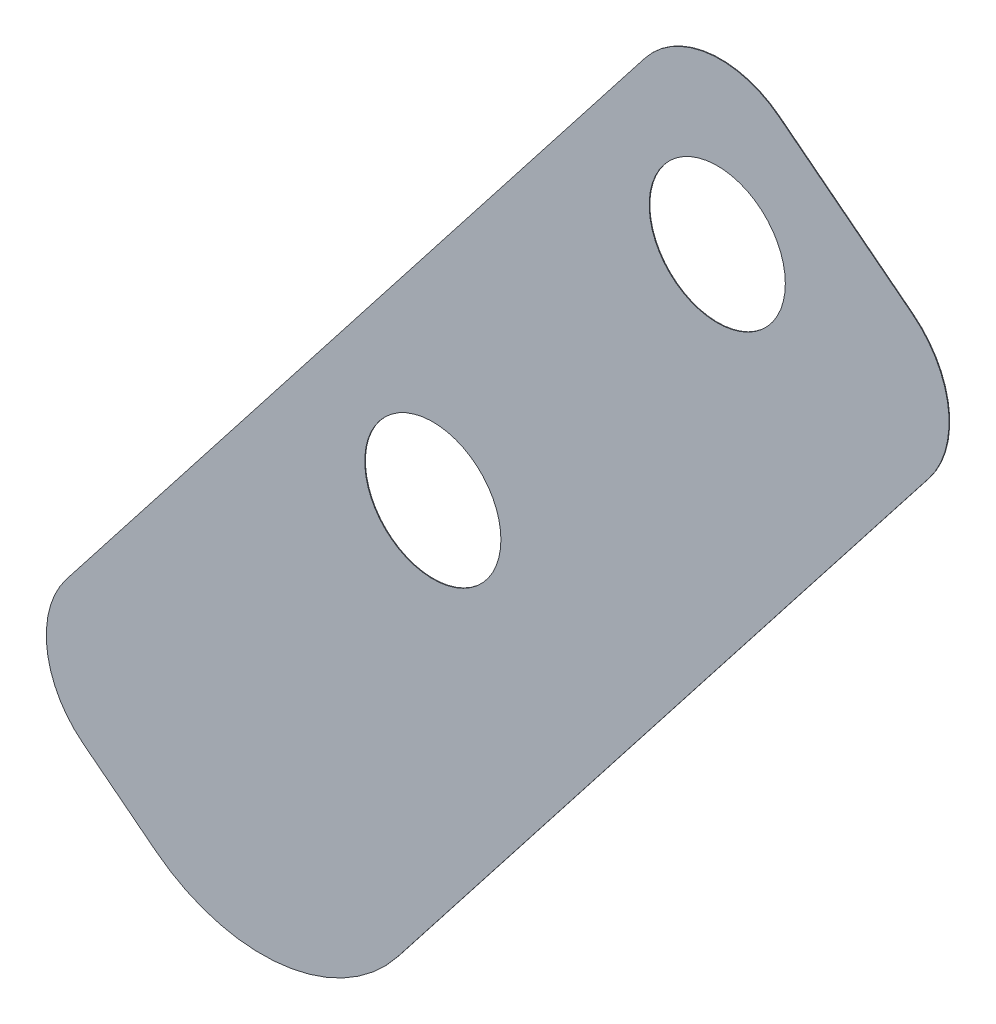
from build123d import *

# Parameters (mm, degrees)
BOSS_EXTRUDE1_DEPTH = 0.0254
HOLE1_D             = 5.6134


with BuildPart() as part:
    # Sketch1 → Boss-Extrude1 (new body)
    with BuildSketch(Plane.XY):
        with BuildLine():
            Line((-501.226828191, -32.043815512), (-525.074475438, -62.567412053))
            ThreePointArc((-525.074475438, -62.567412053), (-525.8797313, -65.471070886), (-524.395936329, -68.093669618))
            Line((-524.395936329, -68.093669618), (-521.393615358, -70.439339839))
            ThreePointArc((-521.393615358, -70.439339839), (-516.148296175, -71.89399559), (-511.410698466, -69.213591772))
            Line((-511.410698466, -69.213591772), (-489.517776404, -41.191929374))
            ThreePointArc((-489.517776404, -41.191929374), (-488.712520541, -38.288270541), (-490.196315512, -35.665671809))
            Line((-490.196315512, -35.665671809), (-495.700570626, -31.365276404))
            ThreePointArc((-495.700570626, -31.365276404), (-498.604229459, -30.560020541), (-501.226828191, -32.043815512))
        make_face()
    extrude(amount=BOSS_EXTRUDE1_DEPTH)

    # Hole1 (through all)
    with Locations(Plane(origin=(-501.896031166, -26.59525055, 0.0254), x_dir=(1, 0, 0), z_dir=(0, 0, 1))):
        with Locations((3.654260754, -10.601140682), (-8.074090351, -25.612745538)):
            Hole(HOLE1_D / 2)


solid = part.part
